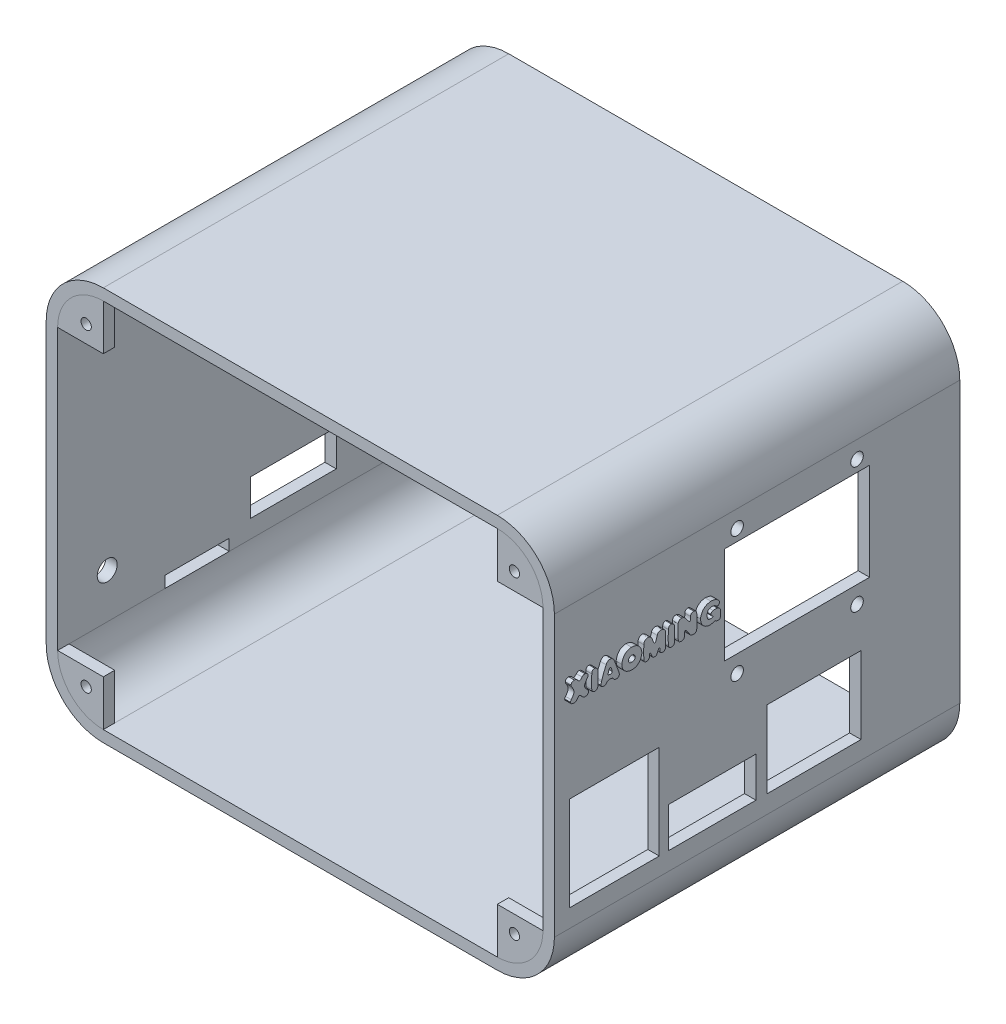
from build123d import *

# Parameters (mm, degrees)
EXTRUDE_1_DEPTH     = 71
SKETCH_2_R          = 0.9
EXTRUDE_2_DEPTH     = 2
EXTRUDE_2_2_DEPTH   = 2
EXTRUDE_2_3_DEPTH   = 2
EXTRUDE_2_4_DEPTH   = 2
EXTRUDE_START       = -2
SKETCH_3_R          = 0.9
EXTRUDE_3_DEPTH     = 2
SKETCH_5_W          = 15.2
SKETCH_5_H          = 16
SKETCH_5_W_2        = 14.8
SKETCH_5_H_2        = 6.5
SKETCH_5_W_3        = 16
SKETCH_5_H_3        = 13
CUT_EXTRUDE_1_DEPTH = 2
SKETCH_6_W          = 15
SKETCH_6_H          = 6.3
SKETCH_6_W_2        = 11.253172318
SKETCH_6_H_2        = 2
CUT_EXTRUDE_2_DEPTH = 2
SKETCH_7_W          = 15.7
SKETCH_7_H          = 16.5
SKETCH_7_W_2        = 15.3
SKETCH_7_H_2        = 7
SKETCH_7_W_3        = 16.5
SKETCH_7_H_3        = 13.5
CUT_EXTRUDE_3_DEPTH = 87
SKETCH_9_R          = 1.1
SKETCH_9_W          = 25.4
SKETCH_9_H          = 17
CUT_EXTRUDE_4_DEPTH = 2
EXTRUDE_4_DEPTH     = 1
SKETCH_11_R         = 1.75
CUT_EXTRUDE_5_DEPTH = 2


with BuildPart() as part:
    # Sketch 1 → Extrude 1 (new body)
    with BuildSketch(Plane.XY):
        with BuildLine():
            Line((8, 67), (77, 67))
            ThreePointArc((77, 67), (84.071067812, 64.071067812), (87, 57))
            Line((87, 57), (87, 8))
            ThreePointArc((87, 8), (84.071067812, 0.928932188), (77, -2))
            Line((77, -2), (8, -2))
            ThreePointArc((8, -2), (0.928932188, 0.928932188), (-2, 8))
            Line((-2, 8), (-2, 57))
            ThreePointArc((-2, 57), (0.928932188, 64.071067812), (8, 67))
        make_face()
        with BuildLine():
            Line((8, 0), (77, 0))
            ThreePointArc((77, 0), (82.656854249, 2.343145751), (85, 8))
            Line((85, 8), (85, 57))
            ThreePointArc((85, 57), (82.656854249, 62.656854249), (77, 65))
            Line((77, 65), (8, 65))
            ThreePointArc((8, 65), (2.343145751, 62.656854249), (0, 57))
            Line((0, 57), (0, 8))
            ThreePointArc((0, 8), (2.343145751, 2.343145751), (8, 0))
        make_face(mode=Mode.SUBTRACT)
    extrude(amount=-EXTRUDE_1_DEPTH)

    # Sketch 3 → Extrude 3 (add)
    # profile 1 of 4: a face of its own
    with BuildSketch(Plane(origin=(0, 0, -71), x_dir=(-1, 0, 0), z_dir=(0, 0, -1)).offset(EXTRUDE_START)):
        with BuildLine():
            Line((-77, 57), (-85, 57))
            ThreePointArc((-85, 57), (-82.656854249, 62.656854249), (-77, 65))
            Line((-77, 65), (-77, 57))
        make_face()
        with Locations(Location((-80, 60, 0), (0, 0, 180))):
            Circle(SKETCH_3_R, mode=Mode.SUBTRACT)
    # profile 2 of 4: a face of its own
    with BuildSketch(Plane(origin=(0, 0, -71), x_dir=(-1, 0, 0), z_dir=(0, 0, -1)).offset(EXTRUDE_START)):
        with BuildLine():
            Line((-8, 65), (-8, 57))
            Line((-8, 57), (0, 57))
            ThreePointArc((0, 57), (-2.343145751, 62.656854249), (-8, 65))
        make_face()
        with Locations(Location((-5, 60, 0), (0, 0, 180))):
            Circle(SKETCH_3_R, mode=Mode.SUBTRACT)
    # profile 3 of 4: a face of its own
    with BuildSketch(Plane(origin=(0, 0, -71), x_dir=(-1, 0, 0), z_dir=(0, 0, -1)).offset(EXTRUDE_START)):
        with BuildLine():
            Line((-8, 0), (-8, 8))
            Line((-8, 8), (0, 8))
            ThreePointArc((0, 8), (-2.343145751, 2.343145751), (-8, 0))
        make_face()
        with Locations(Location((-5, 5, 0), (0, 0, 180))):
            Circle(SKETCH_3_R, mode=Mode.SUBTRACT)
    # profile 4 of 4: a face of its own
    with BuildSketch(Plane(origin=(0, 0, -71), x_dir=(-1, 0, 0), z_dir=(0, 0, -1)).offset(EXTRUDE_START)):
        with BuildLine():
            Line((-77, 0), (-77, 8))
            Line((-77, 8), (-85, 8))
            ThreePointArc((-85, 8), (-82.656854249, 2.343145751), (-77, 0))
        make_face()
        with Locations(Location((-80, 5, 0), (0, 0, 180))):
            Circle(SKETCH_3_R, mode=Mode.SUBTRACT)
    extrude(amount=EXTRUDE_3_DEPTH)

    # Sketch 5 → Cut-Extrude 1 (cut)
    with BuildSketch(Plane(origin=(87, 0, 0), x_dir=(0, 0, -1), z_dir=(1, 0, 0))):
        with Locations((10.259998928, 19.140011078)):
            Rectangle(SKETCH_5_W, SKETCH_5_H)
        with Locations((27.899998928, 14.390011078)):
            Rectangle(SKETCH_5_W_2, SKETCH_5_H_2)
        with Locations((45.199998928, 17.640011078)):
            Rectangle(SKETCH_5_W_3, SKETCH_5_H_3)
    extrude(amount=-CUT_EXTRUDE_1_DEPTH, mode=Mode.SUBTRACT)

    # Sketch 6 → Cut-Extrude 2 (cut)
    with BuildSketch(Plane.ZY.offset(2)):
        with Locations((-41.299987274, 14.289982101)):
            Rectangle(SKETCH_6_W, SKETCH_6_H)
        with Locations((-24.426573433, 8.999982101)):
            Rectangle(SKETCH_6_W_2, SKETCH_6_H_2)
    extrude(amount=-CUT_EXTRUDE_2_DEPTH, mode=Mode.SUBTRACT)

    # Sketch 7 → Cut-Extrude 3 (cut)
    with BuildSketch(Plane(origin=(87, 0, 0), x_dir=(0, 0, -1), z_dir=(1, 0, 0))):
        with Locations((10.509998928, 19.390011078)):
            Rectangle(SKETCH_7_W, SKETCH_7_H)
        with Locations((27.649998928, 14.640011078)):
            Rectangle(SKETCH_7_W_2, SKETCH_7_H_2)
        with Locations((45.449998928, 17.890011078)):
            Rectangle(SKETCH_7_W_3, SKETCH_7_H_3)
    extrude(amount=-CUT_EXTRUDE_3_DEPTH, mode=Mode.SUBTRACT)

    # Sketch 9 → Cut-Extrude 4 (cut)
    with BuildSketch(Plane(origin=(87, 0, 0), x_dir=(0, 0, -1), z_dir=(1, 0, 0))):
        with Locations((32, 54)):
            Circle(SKETCH_9_R)
        with Locations((53, 54)):
            Circle(SKETCH_9_R)
        with Locations((32, 32)):
            Circle(SKETCH_9_R)
        with Locations((53, 32)):
            Circle(SKETCH_9_R)
        with Locations((42.5, 43.5)):
            Rectangle(SKETCH_9_W, SKETCH_9_H)
    extrude(amount=-CUT_EXTRUDE_4_DEPTH, mode=Mode.SUBTRACT)

    # Sketch 10 → Extrude 4 (add)
    # profile 1 of 8: a face of its own
    with BuildSketch(Plane(origin=(87, 0, 0), x_dir=(0, 0, -1), z_dir=(1, 0, 0))):
        with BuildLine():
            add(Edge.make_bspline(
                [(4.883857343, 43.565527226), (4.836471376, 43.611064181), (4.745934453, 43.698068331), (4.623432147, 43.829940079), (4.520112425, 43.955706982), (4.434978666, 44.074983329), (4.370639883, 44.18900654), (4.322846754, 44.296119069), (4.29515972, 44.398184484), (4.287606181, 44.497305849), (4.299791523, 44.59683092), (4.326285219, 44.701932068), (4.368281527, 44.815457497), (4.425891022, 44.937098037), (4.499275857, 45.067019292), (4.587498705, 45.205831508), (4.69118209, 45.353315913), (4.768409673, 45.452235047), (4.808588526, 45.503699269)],
                knots=[0, 0, 0, 0, 1.383602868, 2.643549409, 3.787215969, 4.809077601, 5.724630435, 6.539697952, 7.272921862, 7.939965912, 8.618973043, 9.374694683, 10.218040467, 11.163372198, 12.205761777, 13.357891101, 14.625401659, 16, 16, 16, 16], degree=3))
            add(Edge.make_bspline(
                [(4.808588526, 45.503699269), (4.818912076, 45.522928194), (4.838327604, 45.559092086), (4.863997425, 45.610509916), (4.885241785, 45.655558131), (4.901906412, 45.694062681), (4.914064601, 45.726136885), (4.921436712, 45.751611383), (4.924715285, 45.771185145), (4.922401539, 45.781788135), (4.921491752, 45.785957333)],
                knots=[0, 0, 0, 0, 1.703778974, 3.20430186, 4.486240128, 5.59123403, 6.480667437, 7.15830677, 7.66903809, 8, 8, 8, 8], degree=3))
            add(Edge.make_bspline(
                [(4.921491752, 45.785957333), (4.913290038, 45.811649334), (4.897488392, 45.861148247), (4.868049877, 45.931095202), (4.834018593, 45.993534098), (4.796341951, 46.049648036), (4.753531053, 46.097712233), (4.707258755, 46.139452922), (4.656699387, 46.174123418), (4.602814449, 46.200011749), (4.550862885, 46.22141068), (4.504070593, 46.240231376), (4.463669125, 46.256315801), (4.429702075, 46.269427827), (4.40232257, 46.279981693), (4.381579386, 46.287875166), (4.36711151, 46.292337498), (4.359539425, 46.293595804), (4.356975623, 46.29402185)],
                knots=[0, 0, 0, 0, 1.610362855, 3.102569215, 4.524476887, 5.85227692, 7.130201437, 8.3585765, 9.567040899, 10.777097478, 11.921320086, 12.923644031, 13.789405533, 14.518641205, 15.098441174, 15.541813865, 15.844864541, 16, 16, 16, 16], degree=3))
            add(Edge.make_bspline(
                [(4.356975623, 46.29402185), (4.316192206, 46.287717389), (4.240812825, 46.276064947), (4.138546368, 46.250564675), (4.055470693, 46.221031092), (3.992029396, 46.184633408), (3.944004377, 46.14687257), (3.904650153, 46.112722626), (3.872803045, 46.081242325), (3.85636624, 46.059334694), (3.848911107, 46.049398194)],
                knots=[0, 0, 0, 0, 1.704117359, 3.149694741, 4.34942045, 5.333932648, 6.155540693, 6.86972321, 7.487347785, 8, 8, 8, 8], degree=3))
            add(Edge.make_bspline(
                [(3.848911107, 46.049398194), (3.824990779, 46.021306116), (3.779434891, 45.967805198), (3.710995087, 45.895107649), (3.648936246, 45.831809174), (3.590748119, 45.780560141), (3.537921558, 45.740004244), (3.490492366, 45.708831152), (3.447261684, 45.689382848), (3.406731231, 45.68002258), (3.365898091, 45.684203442), (3.323559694, 45.701819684), (3.277348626, 45.730682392), (3.226391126, 45.770836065), (3.171715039, 45.823637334), (3.112613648, 45.88824697), (3.048463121, 45.964116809), (3.005832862, 46.019925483), (2.983319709, 46.049398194)],
                knots=[0, 0, 0, 0, 1.527102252, 2.908342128, 4.132359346, 5.195351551, 6.114748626, 6.888466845, 7.538792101, 8.068763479, 8.590291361, 9.208240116, 9.950416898, 10.841099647, 11.88866757, 13.09322539, 14.464924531, 16, 16, 16, 16], degree=3))
            add(Edge.make_bspline(
                [(2.983319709, 46.049398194), (2.955712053, 46.073050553), (2.902341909, 46.118774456), (2.816891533, 46.174386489), (2.731823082, 46.218118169), (2.660438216, 46.242753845), (2.606665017, 46.257030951), (2.572524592, 46.267435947), (2.543136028, 46.27430297), (2.519566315, 46.282092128), (2.500630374, 46.286198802), (2.487644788, 46.290796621), (2.479684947, 46.292921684), (2.476184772, 46.293790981), (2.475255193, 46.29402185)],
                knots=[0, 0, 0, 0, 2.289414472, 4.425815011, 6.410154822, 8.304429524, 9.17139153, 9.917654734, 10.553441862, 11.072422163, 11.480878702, 11.772655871, 11.939621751, 12, 12, 12, 12], degree=3))
            add(Edge.make_bspline(
                [(2.475255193, 46.29402185), (2.443784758, 46.287511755), (2.383586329, 46.275058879), (2.298729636, 46.249901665), (2.223310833, 46.220575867), (2.156276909, 46.188463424), (2.099598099, 46.150568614), (2.051628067, 46.109144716), (2.013638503, 46.062803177), (1.985555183, 46.013357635), (1.965291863, 45.964948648), (1.947014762, 45.922040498), (1.93237719, 45.885075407), (1.92083493, 45.854104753), (1.913046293, 45.828629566), (1.908961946, 45.809267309), (1.906638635, 45.795096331), (1.909608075, 45.78847807), (1.910739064, 45.785957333)],
                knots=[0, 0, 0, 0, 1.865869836, 3.569141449, 5.132599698, 6.562638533, 7.876096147, 9.080604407, 10.231159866, 11.337350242, 12.370269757, 13.27735863, 14.046528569, 14.678214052, 15.199017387, 15.585373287, 15.842078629, 16, 16, 16, 16], degree=3))
            add(Edge.make_bspline(
                [(1.910739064, 45.785957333), (1.909017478, 45.758953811), (1.9056749, 45.706524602), (1.921685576, 45.630241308), (1.954254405, 45.560824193), (1.987771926, 45.522962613), (2.004825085, 45.503699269)],
                knots=[0, 0, 0, 0, 1.050010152, 2.038667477, 3.00210654, 4, 4, 4, 4], degree=3))
            add(Edge.make_bspline(
                [(2.004825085, 45.503699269), (2.037437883, 45.453491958), (2.10024059, 45.356807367), (2.185574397, 45.214228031), (2.257617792, 45.079526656), (2.317387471, 44.953168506), (2.364737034, 44.83489718), (2.398302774, 44.724276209), (2.420958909, 44.622321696), (2.430333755, 44.525331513), (2.424365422, 44.428486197), (2.402228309, 44.327016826), (2.365491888, 44.217934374), (2.312433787, 44.101666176), (2.244008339, 43.977776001), (2.160147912, 43.846496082), (2.06061529, 43.707492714), (1.986881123, 43.614232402), (1.948373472, 43.565527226)],
                knots=[0, 0, 0, 0, 1.324562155, 2.550719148, 3.675150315, 4.702952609, 5.642150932, 6.490905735, 7.258062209, 7.949566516, 8.639540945, 9.395579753, 10.240778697, 11.181733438, 12.219155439, 13.369864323, 14.626412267, 16, 16, 16, 16], degree=3))
            add(Edge.make_bspline(
                [(1.948373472, 43.565527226), (1.933954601, 43.541839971), (1.907022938, 43.497596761), (1.869828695, 43.435998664), (1.840275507, 43.382723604), (1.817953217, 43.338452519), (1.802068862, 43.302674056), (1.793313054, 43.276608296), (1.789621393, 43.256417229), (1.79561846, 43.248545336), (1.797835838, 43.245634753)],
                knots=[0, 0, 0, 0, 1.843424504, 3.443160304, 4.784176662, 5.889230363, 6.747010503, 7.362433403, 7.764263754, 8, 8, 8, 8], degree=3))
            add(Edge.make_bspline(
                [(1.797835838, 43.245634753), (1.801678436, 43.221591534), (1.809095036, 43.175185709), (1.829125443, 43.109704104), (1.857638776, 43.051768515), (1.892239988, 43.000014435), (1.935967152, 42.956265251), (1.98630084, 42.919019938), (2.044387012, 42.889612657), (2.107516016, 42.86856501), (2.17019256, 42.852654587), (2.227171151, 42.837552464), (2.277184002, 42.826291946), (2.319722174, 42.81811037), (2.355056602, 42.812043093), (2.382648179, 42.80948759), (2.403576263, 42.807994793), (2.414422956, 42.811445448), (2.41880358, 42.812839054)],
                knots=[0, 0, 0, 0, 1.391689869, 2.686101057, 3.89838733, 5.074075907, 6.229771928, 7.417710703, 8.641880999, 9.936155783, 11.215751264, 12.340478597, 13.307540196, 14.146646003, 14.819464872, 15.353610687, 15.738944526, 16, 16, 16, 16], degree=3))
            add(Edge.make_bspline(
                [(2.41880358, 42.812839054), (2.457052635, 42.816312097), (2.528572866, 42.822806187), (2.626472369, 42.845708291), (2.709565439, 42.87336129), (2.774837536, 42.913200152), (2.827513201, 42.954795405), (2.873303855, 42.991974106), (2.91213454, 43.025673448), (2.935065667, 43.047400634), (2.9456853, 43.05746271)],
                knots=[0, 0, 0, 0, 1.541214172, 2.881848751, 4.033527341, 5.042161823, 5.934638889, 6.730708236, 7.41217837, 8, 8, 8, 8], degree=3))
            add(Edge.make_bspline(
                [(2.9456853, 43.05746271), (2.969752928, 43.094388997), (3.014984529, 43.163786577), (3.083468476, 43.258128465), (3.14640474, 43.337253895), (3.204910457, 43.400911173), (3.259132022, 43.448944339), (3.308543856, 43.48251059), (3.354459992, 43.500630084), (3.398753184, 43.501830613), (3.441459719, 43.485556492), (3.488179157, 43.460131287), (3.540377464, 43.42212819), (3.598990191, 43.373459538), (3.662240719, 43.310983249), (3.732138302, 43.237497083), (3.808498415, 43.15225481), (3.859601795, 43.090187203), (3.886545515, 43.05746271)],
                knots=[0, 0, 0, 0, 1.601628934, 3.010028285, 4.234935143, 5.274303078, 6.147940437, 6.862177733, 7.436337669, 7.917640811, 8.432917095, 9.075055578, 9.850398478, 10.773543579, 11.842293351, 13.07840876, 14.459621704, 16, 16, 16, 16], degree=3))
            add(Edge.make_bspline(
                [(3.886545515, 43.05746271), (3.911630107, 43.030925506), (3.95985441, 42.979908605), (4.041530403, 42.917647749), (4.126123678, 42.870280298), (4.199477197, 42.843703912), (4.256210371, 42.830963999), (4.293114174, 42.821224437), (4.325498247, 42.814910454), (4.352763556, 42.811072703), (4.375038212, 42.807827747), (4.392265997, 42.806795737), (4.405160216, 42.80815536), (4.411151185, 42.811549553), (4.413427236, 42.812839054)],
                knots=[0, 0, 0, 0, 2.181855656, 4.194545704, 6.116953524, 7.963500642, 8.836605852, 9.595096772, 10.246579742, 10.808765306, 11.243210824, 11.590967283, 11.844602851, 12, 12, 12, 12], degree=3))
            add(Edge.make_bspline(
                [(4.413427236, 42.812839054), (4.444848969, 42.816379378), (4.504940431, 42.823149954), (4.590139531, 42.839287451), (4.66666304, 42.858866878), (4.733610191, 42.884278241), (4.792716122, 42.912209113), (4.841499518, 42.94656529), (4.88208173, 42.984711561), (4.911895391, 43.027502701), (4.935333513, 43.069800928), (4.956094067, 43.108113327), (4.974508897, 43.141519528), (4.989310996, 43.170738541), (5.000228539, 43.195840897), (5.00889494, 43.216046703), (5.014460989, 43.232100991), (5.015249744, 43.241659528), (5.015577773, 43.245634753)],
                knots=[0, 0, 0, 0, 1.888125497, 3.610883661, 5.176042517, 6.598775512, 7.883385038, 9.069077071, 10.148595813, 11.192291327, 12.168196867, 13.037558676, 13.795069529, 14.446675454, 14.993347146, 15.428857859, 15.76247215, 16, 16, 16, 16], degree=3))
            add(Edge.make_bspline(
                [(5.015577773, 43.245634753), (5.008924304, 43.280677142), (4.996468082, 43.346281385), (4.967469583, 43.435463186), (4.931662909, 43.509285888), (4.899017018, 43.547692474), (4.883857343, 43.565527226)],
                knots=[0, 0, 0, 0, 1.21871494, 2.281604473, 3.202033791, 4, 4, 4, 4], degree=3))
        make_face()
    # profile 2 of 8: a face of its own
    with BuildSketch(Plane(origin=(87, 0, 0), x_dir=(0, 0, -1), z_dir=(1, 0, 0))):
        with BuildLine():
            add(Edge.make_bspline(
                [(6.622009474, 43.302086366), (6.629874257, 43.499756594), (6.645590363, 43.894758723), (6.653074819, 44.48780241), (6.645610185, 45.080614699), (6.629874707, 45.475616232), (6.622009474, 45.673054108)],
                knots=[0, 0, 0, 0, 1.00085636, 1.999999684, 3.000318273, 4, 4, 4, 4], degree=3))
            add(Edge.make_bspline(
                [(6.622009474, 45.673054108), (6.615521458, 45.703143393), (6.603022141, 45.761111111), (6.577259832, 45.842788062), (6.5466851, 45.915964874), (6.511048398, 45.980397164), (6.471294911, 46.036940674), (6.426534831, 46.084904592), (6.376427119, 46.124053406), (6.322311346, 46.15258262), (6.270155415, 46.175982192), (6.223336, 46.196854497), (6.183087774, 46.215139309), (6.149133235, 46.229689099), (6.121634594, 46.240912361), (6.100862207, 46.249295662), (6.086538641, 46.254773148), (6.078880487, 46.255981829), (6.076310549, 46.256387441)],
                knots=[0, 0, 0, 0, 1.729165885, 3.331278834, 4.805622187, 6.178984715, 7.461464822, 8.680644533, 9.853214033, 11.01607612, 12.108495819, 13.06693283, 13.896783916, 14.592803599, 15.143171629, 15.565023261, 15.854029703, 16, 16, 16, 16], degree=3))
            add(Edge.make_bspline(
                [(6.076310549, 46.256387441), (6.044862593, 46.25149878), (5.985064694, 46.242203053), (5.900964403, 46.221879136), (5.826815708, 46.197973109), (5.7626824, 46.169401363), (5.708181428, 46.136788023), (5.663878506, 46.099553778), (5.627927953, 46.058853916), (5.598385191, 45.998046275), (5.573126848, 45.923011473), (5.553065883, 45.835400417), (5.543407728, 45.752390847), (5.547471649, 45.698842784), (5.549428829, 45.673054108)],
                knots=[0, 0, 0, 0, 1.272642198, 2.419913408, 3.457288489, 4.384828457, 5.223164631, 5.988250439, 6.693851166, 7.375547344, 8.67458471, 9.855938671, 10.967422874, 12, 12, 12, 12], degree=3))
            add(Edge.make_bspline(
                [(5.549428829, 45.673054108), (5.542023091, 45.574350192), (5.527220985, 45.377067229), (5.512858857, 45.080545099), (5.504628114, 44.784051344), (5.501791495, 44.487570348), (5.504614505, 44.191320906), (5.512895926, 43.894829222), (5.527192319, 43.598304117), (5.542019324, 43.40079011), (5.549428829, 43.302086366)],
                knots=[0, 0, 0, 0, 1.000861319, 2.000456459, 3.00157964, 4.000000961, 4.998422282, 5.997197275, 6.999138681, 8, 8, 8, 8], degree=3))
            add(Edge.make_bspline(
                [(5.549428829, 43.302086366), (5.553061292, 43.270635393), (5.55996855, 43.210830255), (5.578362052, 43.126698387), (5.601061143, 43.051974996), (5.632329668, 42.988220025), (5.66763492, 42.933146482), (5.710112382, 42.888736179), (5.758104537, 42.853205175), (5.811915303, 42.830999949), (5.86448752, 42.815096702), (5.912031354, 42.79948819), (5.953699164, 42.78597687), (5.98988374, 42.775886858), (6.01969748, 42.767135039), (6.043710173, 42.761642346), (6.061801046, 42.757769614), (6.072119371, 42.756786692), (6.076310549, 42.756387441)],
                knots=[0, 0, 0, 0, 1.797407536, 3.417834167, 4.886953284, 6.220929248, 7.439808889, 8.58797721, 9.694115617, 10.804967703, 11.873381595, 12.816598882, 13.647192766, 14.361435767, 14.950604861, 15.411568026, 15.760986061, 16, 16, 16, 16], degree=3))
            add(Edge.make_bspline(
                [(6.076310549, 42.756387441), (6.106118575, 42.759851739), (6.16331982, 42.766499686), (6.244126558, 42.783699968), (6.315819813, 42.80665345), (6.378372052, 42.834448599), (6.432628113, 42.867053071), (6.476833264, 42.906594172), (6.512738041, 42.950905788), (6.544908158, 43.015046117), (6.572315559, 43.092200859), (6.600589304, 43.173970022), (6.617326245, 43.242662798), (6.620576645, 43.283905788), (6.622009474, 43.302086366)],
                knots=[0, 0, 0, 0, 1.252866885, 2.404236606, 3.444431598, 4.39119037, 5.258223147, 6.076085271, 6.856484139, 7.624724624, 9.059069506, 10.27413246, 11.239209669, 12, 12, 12, 12], degree=3))
        make_face()
    # profile 3 of 8: a face of its own
    with BuildSketch(Plane(origin=(87, 0, 0), x_dir=(0, 0, -1), z_dir=(1, 0, 0))):
        with BuildLine():
            add(Edge.make_bspline(
                [(8.114841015, 42.982193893), (8.129707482, 43.00502942), (8.159304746, 43.050492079), (8.216204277, 43.109216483), (8.281384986, 43.159942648), (8.354978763, 43.203482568), (8.437847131, 43.238118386), (8.529349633, 43.26445716), (8.629488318, 43.282940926), (8.735752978, 43.293903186), (8.843105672, 43.295674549), (8.946137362, 43.28647071), (9.042249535, 43.264701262), (9.131246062, 43.231319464), (9.213151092, 43.185891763), (9.288430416, 43.129928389), (9.356094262, 43.061556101), (9.393933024, 43.008995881), (9.413228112, 42.982193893)],
                knots=[0, 0, 0, 0, 0.86626335, 1.724621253, 2.589081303, 3.491382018, 4.439691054, 5.441898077, 6.518742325, 7.679141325, 8.840978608, 9.933647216, 10.965810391, 11.970445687, 12.950778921, 13.939371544, 14.949225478, 16, 16, 16, 16], degree=3))
            add(Edge.make_bspline(
                [(9.413228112, 42.982193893), (9.426700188, 42.958537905), (9.45317975, 42.912041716), (9.513320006, 42.85758578), (9.584461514, 42.815530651), (9.665408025, 42.793412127), (9.741487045, 42.777967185), (9.804701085, 42.767612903), (9.849724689, 42.758298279), (9.874344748, 42.756911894), (9.883658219, 42.756387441)],
                knots=[0, 0, 0, 0, 1.187119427, 2.333300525, 3.511244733, 4.781064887, 5.988089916, 6.919531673, 7.591271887, 8, 8, 8, 8], degree=3))
            add(Edge.make_bspline(
                [(9.883658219, 42.756387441), (9.909286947, 42.759674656), (9.958298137, 42.765960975), (10.027794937, 42.781825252), (10.090608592, 42.799890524), (10.146084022, 42.823125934), (10.194640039, 42.849510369), (10.236442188, 42.879593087), (10.271410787, 42.913958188), (10.304900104, 42.96341982), (10.336212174, 43.020313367), (10.365102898, 43.077589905), (10.386071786, 43.118659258), (10.39018878, 43.142620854), (10.391722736, 43.151548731)],
                knots=[0, 0, 0, 0, 1.338475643, 2.559638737, 3.691067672, 4.721984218, 5.670495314, 6.549588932, 7.384004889, 8.195874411, 9.635647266, 10.745011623, 11.532402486, 12, 12, 12, 12], degree=3))
            add(Edge.make_bspline(
                [(10.391722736, 43.151548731), (10.387921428, 43.171557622), (10.379839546, 43.214098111), (10.36372095, 43.281412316), (10.341734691, 43.355327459), (10.321313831, 43.420318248), (10.303320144, 43.471881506), (10.293260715, 43.507390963), (10.284493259, 43.537913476), (10.279009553, 43.563789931), (10.275302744, 43.584979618), (10.273635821, 43.601424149), (10.274155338, 43.613965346), (10.277498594, 43.619709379), (10.27881951, 43.621978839)],
                knots=[0, 0, 0, 0, 1.5048796, 3.199493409, 5.111836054, 7.201984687, 8.233399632, 9.145969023, 9.928878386, 10.57871311, 11.100809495, 11.514231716, 11.808073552, 12, 12, 12, 12], degree=3))
            add(Edge.make_bspline(
                [(10.27881951, 43.621978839), (10.270611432, 43.641931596), (10.255884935, 43.677729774), (10.237280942, 43.72569882), (10.225802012, 43.762268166), (10.223333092, 43.783164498), (10.222367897, 43.791333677)],
                knots=[0, 0, 0, 0, 1.444999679, 2.592541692, 3.449770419, 4, 4, 4, 4], degree=3))
            add(Edge.make_bspline(
                [(10.222367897, 43.791333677), (10.167344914, 43.95815001), (10.056570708, 44.293990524), (9.875844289, 44.796597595), (9.680042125, 45.30109536), (9.540094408, 45.636177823), (9.469679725, 45.804774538)],
                knots=[0, 0, 0, 0, 0.980264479, 1.973502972, 2.980368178, 4, 4, 4, 4], degree=3))
            add(Edge.make_bspline(
                [(9.469679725, 45.804774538), (9.446037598, 45.844979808), (9.400598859, 45.92225191), (9.322882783, 46.026274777), (9.240201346, 46.114297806), (9.153034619, 46.187284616), (9.059863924, 46.242866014), (8.962506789, 46.283290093), (8.860264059, 46.308356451), (8.754861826, 46.315097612), (8.649663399, 46.308383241), (8.548163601, 46.283209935), (8.451857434, 46.243359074), (8.3610426, 46.187116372), (8.276678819, 46.114175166), (8.196839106, 46.026281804), (8.122534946, 45.922372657), (8.080329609, 45.844997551), (8.058389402, 45.804774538)],
                knots=[0, 0, 0, 0, 1.220841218, 2.34638312, 3.392213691, 4.37763556, 5.313565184, 6.221959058, 7.129476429, 8.056664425, 8.977784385, 9.879388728, 10.782162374, 11.697295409, 12.664059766, 13.693336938, 14.800894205, 16, 16, 16, 16], degree=3))
            add(Edge.make_bspline(
                [(8.058389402, 45.804774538), (7.985220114, 45.638692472), (7.83946496, 45.307852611), (7.642275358, 44.805117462), (7.462828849, 44.300364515), (7.357953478, 43.960610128), (7.30570123, 43.791333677)],
                knots=[0, 0, 0, 0, 1.012337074, 2.016602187, 3.011808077, 4, 4, 4, 4], degree=3))
            add(Edge.make_bspline(
                [(7.30570123, 43.791333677), (7.297493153, 43.77138092), (7.282766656, 43.735582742), (7.264162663, 43.687613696), (7.252683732, 43.651044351), (7.250214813, 43.630148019), (7.249249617, 43.621978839)],
                knots=[0, 0, 0, 0, 1.444999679, 2.592541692, 3.449770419, 4, 4, 4, 4], degree=3))
            add(Edge.make_bspline(
                [(7.249249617, 43.621978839), (7.237498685, 43.583911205), (7.215683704, 43.513240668), (7.187347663, 43.414700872), (7.163562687, 43.331967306), (7.148084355, 43.265377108), (7.133489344, 43.213420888), (7.131598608, 43.181324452), (7.125355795, 43.156077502), (7.133969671, 43.15252808), (7.136346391, 43.151548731)],
                knots=[0, 0, 0, 0, 1.949728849, 3.619567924, 5.023884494, 6.149177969, 7.001533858, 7.575670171, 7.882919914, 8, 8, 8, 8], degree=3))
            add(Edge.make_bspline(
                [(7.136346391, 43.151548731), (7.141513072, 43.129136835), (7.151435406, 43.086095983), (7.172305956, 43.025669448), (7.19803381, 42.972153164), (7.228851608, 42.92559086), (7.264425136, 42.886095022), (7.305177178, 42.854276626), (7.349964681, 42.828406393), (7.399085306, 42.812556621), (7.446853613, 42.799968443), (7.490826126, 42.788798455), (7.529460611, 42.779322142), (7.562528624, 42.770597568), (7.590393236, 42.764117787), (7.613265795, 42.760314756), (7.630609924, 42.756910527), (7.640452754, 42.756537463), (7.644410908, 42.756387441)],
                knots=[0, 0, 0, 0, 1.565105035, 3.005700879, 4.342631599, 5.597222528, 6.795204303, 7.943828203, 9.105230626, 10.295776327, 11.44298372, 12.471050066, 13.384028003, 14.151245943, 14.799718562, 15.330216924, 15.730656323, 16, 16, 16, 16], degree=3))
            add(Edge.make_bspline(
                [(7.644410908, 42.756387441), (7.682131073, 42.759936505), (7.751666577, 42.766479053), (7.846200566, 42.784365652), (7.922886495, 42.806610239), (7.981646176, 42.837427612), (8.025729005, 42.872910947), (8.063128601, 42.907169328), (8.092962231, 42.943616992), (8.10773673, 42.969667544), (8.114841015, 42.982193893)],
                knots=[0, 0, 0, 0, 1.66019372, 3.060495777, 4.213745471, 5.147810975, 5.94644216, 6.688581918, 7.369407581, 8, 8, 8, 8], degree=3))
        make_face()
        with BuildLine():
            add(Edge.make_bspline(
                [(9.130970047, 44.261763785), (9.129821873, 44.240869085), (9.127626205, 44.200911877), (9.105193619, 44.145067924), (9.068721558, 44.097771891), (9.017791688, 44.061501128), (8.958569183, 44.033342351), (8.892450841, 44.013417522), (8.820649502, 44.000739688), (8.745099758, 43.997064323), (8.669557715, 44.000778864), (8.597979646, 44.013418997), (8.531880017, 44.033337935), (8.481853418, 44.057114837), (8.446695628, 44.080041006), (8.425487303, 44.100002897), (8.40807684, 44.121751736), (8.396562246, 44.146184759), (8.389009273, 44.172320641), (8.387488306, 44.200443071), (8.389301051, 44.230773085), (8.394424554, 44.251134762), (8.39709908, 44.261763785)],
                knots=[0, 0, 0, 0, 1.203197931, 2.300891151, 3.421447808, 4.611751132, 5.879590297, 7.201169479, 8.592666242, 10.086077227, 11.566073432, 12.957570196, 14.279149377, 15.546988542, 16.146897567, 16.698205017, 17.224900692, 17.747640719, 18.249596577, 18.788487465, 19.367576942, 20, 20, 20, 20], degree=3))
            add(Edge.make_bspline(
                [(8.39709908, 44.261763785), (8.404861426, 44.295945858), (8.419835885, 44.361887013), (8.443782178, 44.457089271), (8.467192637, 44.545225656), (8.490741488, 44.626151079), (8.514781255, 44.699697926), (8.537691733, 44.766579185), (8.562879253, 44.82581166), (8.585434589, 44.87891343), (8.610498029, 44.923900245), (8.634336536, 44.962105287), (8.658345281, 44.993654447), (8.682338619, 45.018253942), (8.706994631, 45.035939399), (8.732512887, 45.045245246), (8.758062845, 45.048737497), (8.792878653, 45.040734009), (8.835993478, 45.015749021), (8.883840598, 44.966835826), (8.927949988, 44.897433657), (8.972887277, 44.809700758), (9.013959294, 44.700978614), (9.056187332, 44.573088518), (9.095223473, 44.424412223), (9.118594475, 44.318073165), (9.130970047, 44.261763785)],
                knots=[0, 0, 0, 0, 1.400354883, 2.701445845, 3.921668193, 5.043581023, 6.067924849, 7.013150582, 7.866314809, 8.639055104, 9.31607419, 9.921134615, 10.437222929, 10.896619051, 11.29049652, 11.637022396, 11.973201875, 12.30447713, 13.04371783, 13.929720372, 15.013437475, 16.316810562, 17.862792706, 19.650213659, 21.696671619, 24, 24, 24, 24], degree=3))
        make_face(mode=Mode.SUBTRACT)
    # profile 4 of 8: a face of its own
    with BuildSketch(Plane(origin=(87, 0, 0), x_dir=(0, 0, -1), z_dir=(1, 0, 0))):
        with BuildLine():
            add(Edge.make_bspline(
                [(10.821730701, 44.468753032), (10.823942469, 44.418303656), (10.828253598, 44.319968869), (10.844165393, 44.176733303), (10.868741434, 44.042051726), (10.899844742, 43.915240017), (10.938713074, 43.796521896), (10.985440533, 43.685953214), (11.039700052, 43.583548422), (11.102438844, 43.490280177), (11.169279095, 43.404065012), (11.239176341, 43.324518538), (11.31103973, 43.251203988), (11.384804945, 43.18381633), (11.461786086, 43.12395483), (11.540653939, 43.070121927), (11.6217447, 43.0222381), (11.731202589, 42.9694308), (11.864866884, 42.914020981), (12.018692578, 42.860645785), (12.161362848, 42.818466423), (12.274003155, 42.7973697), (12.355902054, 42.785356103), (12.408388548, 42.777569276), (12.453680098, 42.771212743), (12.491606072, 42.766544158), (12.522062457, 42.762542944), (12.544921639, 42.758396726), (12.560813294, 42.75731914), (12.568943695, 42.756625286), (12.571730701, 42.756387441)],
                knots=[0, 0, 0, 0, 1.553776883, 3.028586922, 4.430914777, 5.764338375, 7.043970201, 8.27093092, 9.454357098, 10.604423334, 11.725570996, 12.809727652, 13.861288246, 14.883718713, 15.881967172, 16.859572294, 17.820885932, 18.776894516, 20.597226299, 22.27038548, 23.786652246, 25.170543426, 25.792371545, 26.334308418, 26.803448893, 27.19983445, 27.510234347, 27.74885525, 27.913910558, 28, 28, 28, 28], degree=3))
            add(Edge.make_bspline(
                [(12.571730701, 42.756387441), (12.62220242, 42.759972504), (12.720632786, 42.766964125), (12.863566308, 42.787141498), (12.998678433, 42.811694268), (13.12550397, 42.843359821), (13.243695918, 42.882971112), (13.354363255, 42.926962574), (13.456402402, 42.978708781), (13.550175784, 43.036912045), (13.636119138, 43.100027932), (13.716765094, 43.164703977), (13.790781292, 43.232454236), (13.858652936, 43.302888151), (13.920074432, 43.376450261), (13.975962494, 43.452022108), (14.025026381, 43.530731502), (14.081120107, 43.63685561), (14.139903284, 43.767478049), (14.199035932, 43.918149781), (14.24447712, 44.059305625), (14.270434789, 44.171333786), (14.284978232, 44.254104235), (14.295250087, 44.308340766), (14.302292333, 44.356608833), (14.309953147, 44.398246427), (14.314310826, 44.434169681), (14.318924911, 44.463557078), (14.321131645, 44.487071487), (14.3215505, 44.500577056), (14.321730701, 44.506387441)],
                knots=[0, 0, 0, 0, 1.546972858, 3.016919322, 4.411738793, 5.745419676, 7.010281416, 8.221386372, 9.384270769, 10.504104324, 11.59264842, 12.64339523, 13.664197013, 14.659081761, 15.632399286, 16.592980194, 17.531313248, 18.465765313, 20.262025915, 21.908555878, 23.413974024, 24.792632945, 25.421090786, 25.984097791, 26.480499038, 26.912649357, 27.278376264, 27.586829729, 27.822245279, 28, 28, 28, 28], degree=3))
            add(Edge.make_bspline(
                [(14.321730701, 44.506387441), (14.31667853, 44.555470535), (14.30682739, 44.651176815), (14.283610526, 44.790537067), (14.254203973, 44.921817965), (14.220667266, 45.046269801), (14.17902969, 45.162275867), (14.133684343, 45.271535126), (14.081020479, 45.372607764), (14.022275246, 45.46561974), (13.959892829, 45.552289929), (13.895278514, 45.633069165), (13.828096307, 45.70805234), (13.758599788, 45.777048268), (13.686465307, 45.839860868), (13.612648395, 45.897487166), (13.535738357, 45.948306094), (13.432103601, 46.00736524), (13.303696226, 46.070583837), (13.151933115, 46.132121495), (13.006427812, 46.1800008), (12.888189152, 46.205253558), (12.799629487, 46.219669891), (12.740055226, 46.230076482), (12.685756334, 46.237050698), (12.63712626, 46.244755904), (12.594007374, 46.248961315), (12.556718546, 46.253826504), (12.524827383, 46.255823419), (12.505291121, 46.25621188), (12.496461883, 46.256387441)],
                knots=[0, 0, 0, 0, 1.480065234, 2.885953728, 4.235338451, 5.515353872, 6.749777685, 7.930335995, 9.061923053, 10.164175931, 11.227968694, 12.264189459, 13.266090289, 14.246822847, 15.200128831, 16.134157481, 17.054274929, 17.962837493, 19.711440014, 21.343469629, 22.873131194, 24.300382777, 24.964946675, 25.565343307, 26.11435036, 26.607174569, 27.042034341, 27.413781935, 27.735064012, 28, 28, 28, 28], degree=3))
            add(Edge.make_bspline(
                [(12.496461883, 46.256387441), (12.447610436, 46.251091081), (12.352352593, 46.240763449), (12.213824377, 46.217073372), (12.083840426, 46.186382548), (11.961638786, 46.150345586), (11.847732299, 46.10741833), (11.742406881, 46.056654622), (11.644082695, 46.00169381), (11.55564147, 45.938038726), (11.474050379, 45.870566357), (11.397354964, 45.801409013), (11.326954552, 45.728990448), (11.260867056, 45.655560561), (11.201954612, 45.578282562), (11.147177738, 45.499935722), (11.098979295, 45.41839844), (11.042995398, 45.309452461), (10.984999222, 45.175271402), (10.924845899, 45.021990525), (10.879850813, 44.878556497), (10.853187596, 44.76603904), (10.839811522, 44.683839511), (10.830084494, 44.631522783), (10.82394115, 44.586366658), (10.819893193, 44.548704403), (10.816754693, 44.518489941), (10.815753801, 44.495518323), (10.816842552, 44.479155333), (10.820438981, 44.471501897), (10.821730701, 44.468753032)],
                knots=[0, 0, 0, 0, 1.527625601, 2.978792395, 4.366456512, 5.678254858, 6.9379672, 8.146349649, 9.311088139, 10.435458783, 11.528677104, 12.602512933, 13.644537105, 14.667917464, 15.672074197, 16.6638922, 17.638837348, 18.614504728, 20.470806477, 22.181182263, 23.732465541, 25.14123255, 25.771823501, 26.32165675, 26.795657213, 27.188121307, 27.500068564, 27.738550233, 27.906095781, 28, 28, 28, 28], degree=3))
        make_face()
        with BuildLine():
            add(Edge.make_bspline(
                [(13.173881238, 44.468753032), (13.168665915, 44.437271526), (13.158712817, 44.377191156), (13.135091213, 44.292672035), (13.104468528, 44.218598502), (13.068260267, 44.153828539), (13.024638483, 44.099164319), (12.973852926, 44.055076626), (12.917275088, 44.019531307), (12.855014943, 43.997740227), (12.794548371, 43.981749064), (12.740369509, 43.966609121), (12.693553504, 43.955560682), (12.654580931, 43.947172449), (12.622892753, 43.941042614), (12.599165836, 43.938834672), (12.582066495, 43.936692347), (12.57447285, 43.940497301), (12.571730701, 43.941871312)],
                knots=[0, 0, 0, 0, 1.712899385, 3.268955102, 4.700819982, 6.008423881, 7.241784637, 8.435382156, 9.605803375, 10.806097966, 11.959438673, 12.967220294, 13.826618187, 14.541136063, 15.111359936, 15.550863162, 15.837811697, 16, 16, 16, 16], degree=3))
            add(Edge.make_bspline(
                [(12.571730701, 43.941871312), (12.537295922, 43.944118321), (12.471864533, 43.948387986), (12.379179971, 43.962858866), (12.296975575, 43.98404617), (12.225291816, 44.012614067), (12.163450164, 44.047335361), (12.112318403, 44.089699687), (12.071521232, 44.138941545), (12.044103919, 44.194494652), (12.024154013, 44.249118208), (12.005512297, 44.298661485), (11.991148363, 44.342219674), (11.979582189, 44.379508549), (11.971857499, 44.410503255), (11.967481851, 44.435310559), (11.965627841, 44.45434566), (11.968439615, 44.464595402), (11.969580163, 44.468753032)],
                knots=[0, 0, 0, 0, 1.831842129, 3.480782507, 4.973997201, 6.330206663, 7.56813816, 8.724382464, 9.838050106, 10.936096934, 11.9945506, 12.927348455, 13.746610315, 14.429607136, 15.001109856, 15.439197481, 15.772520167, 16, 16, 16, 16], degree=3))
            add(Edge.make_bspline(
                [(11.969580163, 44.468753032), (11.974881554, 44.500212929), (11.985025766, 44.560411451), (12.007626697, 44.645486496), (12.037763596, 44.720391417), (12.073109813, 44.78616668), (12.115212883, 44.842145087), (12.163852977, 44.887918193), (12.218457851, 44.924764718), (12.278585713, 44.948752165), (12.337503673, 44.966981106), (12.390782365, 44.984027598), (12.437499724, 44.997263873), (12.477401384, 45.007398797), (12.510769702, 45.013556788), (12.537176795, 45.017385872), (12.557099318, 45.018330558), (12.567572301, 45.015554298), (12.571730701, 45.014451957)],
                knots=[0, 0, 0, 0, 1.692354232, 3.238320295, 4.659761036, 5.967171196, 7.189970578, 8.358443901, 9.496883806, 10.662232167, 11.777071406, 12.771238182, 13.629671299, 14.353157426, 14.95513427, 15.427574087, 15.772712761, 16, 16, 16, 16], degree=3))
            add(Edge.make_bspline(
                [(12.571730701, 45.014451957), (12.604609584, 45.009497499), (12.667652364, 44.9999977), (12.756300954, 44.976502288), (12.835515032, 44.949254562), (12.90495216, 44.915867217), (12.963786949, 44.875811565), (13.013908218, 44.83113763), (13.052749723, 44.779492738), (13.080171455, 44.723748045), (13.10127002, 44.669602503), (13.120038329, 44.620937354), (13.13603699, 44.579108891), (13.14949223, 44.544112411), (13.159775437, 44.515696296), (13.167606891, 44.494245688), (13.172319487, 44.479376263), (13.173469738, 44.471552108), (13.173881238, 44.468753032)],
                knots=[0, 0, 0, 0, 1.802693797, 3.456529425, 4.967354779, 6.342727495, 7.622182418, 8.817616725, 9.969605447, 11.102614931, 12.176898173, 13.122518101, 13.932403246, 14.606558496, 15.156811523, 15.571397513, 15.846668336, 16, 16, 16, 16], degree=3))
        make_face(mode=Mode.SUBTRACT)
    # profile 5 of 8: a face of its own
    with BuildSketch(Plane(origin=(87, 0, 0), x_dir=(0, 0, -1), z_dir=(1, 0, 0))):
        with BuildLine():
            add(Edge.make_bspline(
                [(16.977047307, 43.019828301), (16.989292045, 43.049360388), (17.013056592, 43.106676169), (17.048609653, 43.189279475), (17.082072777, 43.266273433), (17.113915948, 43.337238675), (17.144781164, 43.402199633), (17.17368451, 43.461411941), (17.201974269, 43.514279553), (17.227047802, 43.561759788), (17.252100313, 43.602522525), (17.274496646, 43.638045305), (17.296137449, 43.667214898), (17.315680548, 43.690950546), (17.334160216, 43.708439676), (17.351068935, 43.71993506), (17.366531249, 43.726954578), (17.386349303, 43.725531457), (17.409175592, 43.710994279), (17.429629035, 43.679802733), (17.447117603, 43.635923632), (17.461309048, 43.577742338), (17.471567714, 43.505601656), (17.480015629, 43.419108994), (17.484558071, 43.318396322), (17.484919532, 43.246335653), (17.485111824, 43.208000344)],
                knots=[0, 0, 0, 0, 1.67307537, 3.247099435, 4.706216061, 6.066565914, 7.317383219, 8.470050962, 9.514191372, 10.455366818, 11.278950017, 12.017468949, 12.652115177, 13.178274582, 13.625635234, 13.976314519, 14.249522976, 14.492979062, 14.983068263, 15.600718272, 16.418086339, 17.447183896, 18.726451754, 20.228938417, 21.993845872, 24, 24, 24, 24], degree=3))
            add(Edge.make_bspline(
                [(17.485111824, 43.208000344), (17.485372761, 43.188219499), (17.485874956, 43.150149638), (17.493624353, 43.095529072), (17.502922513, 43.044853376), (17.520001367, 42.999340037), (17.538688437, 42.957015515), (17.563733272, 42.919864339), (17.592171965, 42.88664831), (17.636691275, 42.849621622), (17.698459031, 42.81229448), (17.779024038, 42.779863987), (17.865322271, 42.760000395), (17.955539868, 42.754540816), (18.045769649, 42.759988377), (18.132033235, 42.779909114), (18.212537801, 42.812053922), (18.273920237, 42.849995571), (18.318939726, 42.886987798), (18.349511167, 42.919862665), (18.376968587, 42.957356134), (18.401071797, 42.999016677), (18.422333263, 43.044883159), (18.439495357, 43.095157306), (18.453480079, 43.149967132), (18.460151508, 43.188200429), (18.463606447, 43.208000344)],
                knots=[0, 0, 0, 0, 0.952260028, 1.83270262, 2.656129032, 3.428090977, 4.169403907, 4.880509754, 5.578808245, 6.269798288, 7.661945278, 9.03829017, 10.439725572, 11.909870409, 13.380015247, 14.781450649, 16.157795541, 17.540410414, 18.239964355, 18.960787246, 19.697520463, 20.475225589, 21.276743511, 22.130073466, 23.031619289, 24, 24, 24, 24], degree=3))
            add(Edge.make_bspline(
                [(18.463606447, 43.208000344), (18.471471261, 43.41194379), (18.487187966, 43.819495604), (18.494671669, 44.431350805), (18.48720718, 45.042974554), (18.471471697, 45.450525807), (18.463606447, 45.654236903)],
                knots=[0, 0, 0, 0, 1.000822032, 1.999999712, 3.000316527, 4, 4, 4, 4], degree=3))
            add(Edge.make_bspline(
                [(18.463606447, 45.654236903), (18.459951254, 45.674274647), (18.452745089, 45.713778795), (18.436944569, 45.771446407), (18.41467653, 45.825845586), (18.389499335, 45.878349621), (18.358020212, 45.927239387), (18.323448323, 45.974551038), (18.282683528, 46.01811013), (18.223214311, 46.072891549), (18.141396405, 46.13321582), (18.033855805, 46.190792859), (17.917971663, 46.23316884), (17.795982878, 46.258842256), (17.671441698, 46.26965915), (17.548498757, 46.259387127), (17.428638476, 46.23141997), (17.333592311, 46.191695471), (17.261029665, 46.15203377), (17.211805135, 46.114720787), (17.166360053, 46.073460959), (17.126669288, 46.02585841), (17.090168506, 45.974261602), (17.061212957, 45.915597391), (17.033783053, 45.853259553), (17.021130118, 45.808677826), (17.014681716, 45.785957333)],
                knots=[0, 0, 0, 0, 0.744281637, 1.46734142, 2.179957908, 2.889990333, 3.591956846, 4.301735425, 5.028771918, 5.767805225, 7.255327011, 8.729120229, 10.211763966, 11.748762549, 13.273140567, 14.763663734, 16.238141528, 17.753318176, 18.513648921, 19.253997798, 20.00502824, 20.751871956, 21.51489984, 22.308535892, 23.137967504, 24, 24, 24, 24], degree=3))
            add(Edge.make_bspline(
                [(17.014681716, 45.785957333), (17.003140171, 45.744353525), (16.980731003, 45.663575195), (16.947093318, 45.547016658), (16.912941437, 45.439274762), (16.881768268, 45.339614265), (16.849134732, 45.249116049), (16.818993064, 45.166804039), (16.788896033, 45.093394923), (16.759805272, 45.028439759), (16.731405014, 44.972166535), (16.704154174, 44.923975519), (16.677702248, 44.884474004), (16.651363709, 44.853775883), (16.626721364, 44.830588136), (16.60162989, 44.816558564), (16.576591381, 44.810528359), (16.552227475, 44.815837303), (16.528667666, 44.827427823), (16.505693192, 44.846644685), (16.481250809, 44.870975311), (16.456405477, 44.902218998), (16.429779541, 44.938839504), (16.403546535, 44.98283244), (16.375543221, 45.03251225), (16.348297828, 45.089326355), (16.318489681, 45.151468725), (16.288657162, 45.220572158), (16.258542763, 45.296396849), (16.225931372, 45.377790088), (16.194258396, 45.466168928), (16.160701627, 45.560603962), (16.126601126, 45.66168871), (16.104169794, 45.731336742), (16.092638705, 45.767140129)],
                knots=[0, 0, 0, 0, 1.893105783, 3.675671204, 5.318760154, 6.848878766, 8.253525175, 9.53632538, 10.692076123, 11.7315064, 12.656255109, 13.45474307, 14.158247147, 14.73607763, 15.226704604, 15.632361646, 15.985952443, 16.327604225, 16.701171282, 17.129108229, 17.633293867, 18.21237992, 18.876665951, 19.617384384, 20.456361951, 21.376555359, 22.378992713, 23.478429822, 24.675761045, 25.956335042, 27.322638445, 28.791696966, 30.350734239, 32, 32, 32, 32], degree=3))
            add(Edge.make_bspline(
                [(16.092638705, 45.767140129), (16.069863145, 45.808989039), (16.025374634, 45.890734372), (15.940565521, 45.998642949), (15.84501989, 46.091121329), (15.737537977, 46.16447372), (15.623619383, 46.220194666), (15.506017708, 46.257792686), (15.385478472, 46.27273646), (15.284494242, 46.269743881), (15.204825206, 46.256271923), (15.146224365, 46.243011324), (15.090193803, 46.22297034), (15.035909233, 46.198587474), (14.984080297, 46.168299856), (14.933280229, 46.134492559), (14.885997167, 46.093917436), (14.840196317, 46.050057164), (14.797954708, 46.001294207), (14.761998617, 45.9474397), (14.730950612, 45.889885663), (14.70586564, 45.828171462), (14.686343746, 45.762335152), (14.672555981, 45.69234039), (14.664027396, 45.618207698), (14.66303805, 45.567376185), (14.662531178, 45.541333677)],
                knots=[0, 0, 0, 0, 1.65646638, 3.235649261, 4.757443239, 6.269662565, 7.745623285, 9.160406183, 10.546952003, 11.955222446, 12.660007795, 13.358451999, 14.044037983, 14.728190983, 15.427477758, 16.131938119, 16.849647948, 17.593280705, 18.339022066, 19.090575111, 19.843302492, 20.612367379, 21.405720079, 22.230608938, 23.093487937, 24, 24, 24, 24], degree=3))
            add(Edge.make_bspline(
                [(14.662531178, 45.541333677), (14.658012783, 45.449583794), (14.648910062, 45.264745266), (14.641339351, 44.984745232), (14.635090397, 44.700163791), (14.634424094, 44.410674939), (14.635137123, 44.116774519), (14.641473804, 43.818024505), (14.649076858, 43.514571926), (14.65802535, 43.310670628), (14.662531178, 43.208000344)],
                knots=[0, 0, 0, 0, 0.944464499, 1.902710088, 2.87982233, 3.871090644, 4.879078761, 5.901565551, 6.943376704, 8, 8, 8, 8], degree=3))
            add(Edge.make_bspline(
                [(14.662531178, 43.208000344), (14.6660538, 43.181219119), (14.672781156, 43.130073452), (14.689079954, 43.057946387), (14.711569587, 42.995037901), (14.737544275, 42.940214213), (14.770162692, 42.894953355), (14.807268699, 42.857875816), (14.850060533, 42.829984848), (14.896593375, 42.812183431), (14.942604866, 42.799949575), (14.984759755, 42.788962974), (15.021906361, 42.779107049), (15.053670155, 42.770758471), (15.08054723, 42.764038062), (15.102518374, 42.760347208), (15.1193855, 42.756874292), (15.129001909, 42.756529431), (15.132961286, 42.756387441)],
                knots=[0, 0, 0, 0, 1.774314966, 3.388512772, 4.846425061, 6.156997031, 7.359966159, 8.493234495, 9.585469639, 10.688000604, 11.750942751, 12.713477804, 13.550160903, 14.275753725, 14.871791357, 15.368717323, 15.740081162, 16, 16, 16, 16], degree=3))
            add(Edge.make_bspline(
                [(15.132961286, 42.756387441), (15.159978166, 42.759678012), (15.211520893, 42.765955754), (15.284329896, 42.781629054), (15.349593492, 42.799978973), (15.406884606, 42.822811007), (15.456296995, 42.849407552), (15.498200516, 42.879208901), (15.531905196, 42.913899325), (15.56351612, 42.964258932), (15.591657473, 43.025923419), (15.62043688, 43.093129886), (15.636528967, 43.153369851), (15.639624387, 43.190975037), (15.641025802, 43.208000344)],
                knots=[0, 0, 0, 0, 1.297638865, 2.47563174, 3.548777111, 4.52829496, 5.410937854, 6.219972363, 6.972381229, 7.700824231, 9.043942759, 10.202489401, 11.186198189, 12, 12, 12, 12], degree=3))
            add(Edge.make_bspline(
                [(15.641025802, 43.208000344), (15.644314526, 43.251923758), (15.650446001, 43.333814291), (15.661799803, 43.447310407), (15.675584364, 43.542231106), (15.690339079, 43.618637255), (15.706724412, 43.677350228), (15.725577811, 43.717282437), (15.746322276, 43.743858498), (15.770709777, 43.74651336), (15.786597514, 43.737238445), (15.800795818, 43.726045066), (15.814941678, 43.70844312), (15.832063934, 43.687219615), (15.848960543, 43.659653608), (15.867912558, 43.627317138), (15.888790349, 43.590118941), (15.910138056, 43.547336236), (15.933499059, 43.499644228), (15.957457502, 43.446566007), (15.982596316, 43.388073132), (16.009893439, 43.324799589), (16.038435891, 43.256107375), (16.067468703, 43.181717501), (16.099084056, 43.102778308), (16.119689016, 43.047977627), (16.130273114, 43.019828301)],
                knots=[0, 0, 0, 0, 2.280243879, 4.251272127, 5.904531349, 7.241905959, 8.284443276, 9.037450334, 9.547711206, 9.934261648, 10.176299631, 10.484340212, 10.867885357, 11.339397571, 11.896545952, 12.538046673, 13.280997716, 14.103944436, 15.012995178, 16.030251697, 17.118343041, 18.309073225, 19.597811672, 20.969096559, 22.443123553, 24, 24, 24, 24], degree=3))
            add(Edge.make_bspline(
                [(16.130273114, 43.019828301), (16.140100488, 42.998798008), (16.159058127, 42.958229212), (16.197036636, 42.904656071), (16.239593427, 42.858051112), (16.289892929, 42.821533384), (16.34476027, 42.791123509), (16.406396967, 42.771563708), (16.473297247, 42.758756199), (16.544256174, 42.755137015), (16.61564547, 42.758864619), (16.68349331, 42.771536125), (16.746622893, 42.791281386), (16.803472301, 42.821429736), (16.855886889, 42.858347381), (16.901850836, 42.904634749), (16.944079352, 42.957909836), (16.965825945, 42.998753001), (16.977047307, 43.019828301)],
                knots=[0, 0, 0, 0, 1.048815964, 2.023233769, 2.960686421, 3.892458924, 4.824112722, 5.788547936, 6.805399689, 7.900944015, 8.996488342, 10.034012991, 11.018424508, 11.977973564, 12.935214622, 13.909405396, 14.921241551, 16, 16, 16, 16], degree=3))
        make_face()
    # profile 6 of 8: a face of its own
    with BuildSketch(Plane(origin=(87, 0, 0), x_dir=(0, 0, -1), z_dir=(1, 0, 0))):
        with BuildLine():
            add(Edge.make_bspline(
                [(20.047736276, 43.302086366), (20.055601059, 43.499756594), (20.071317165, 43.894758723), (20.078801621, 44.48780241), (20.071336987, 45.080614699), (20.05560151, 45.475616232), (20.047736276, 45.673054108)],
                knots=[0, 0, 0, 0, 1.00085636, 1.999999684, 3.000318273, 4, 4, 4, 4], degree=3))
            add(Edge.make_bspline(
                [(20.047736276, 45.673054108), (20.04124826, 45.703143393), (20.028748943, 45.761111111), (20.002986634, 45.842788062), (19.972411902, 45.915964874), (19.936775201, 45.980397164), (19.897021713, 46.036940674), (19.852261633, 46.084904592), (19.802153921, 46.124053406), (19.748038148, 46.15258262), (19.695882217, 46.175982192), (19.649062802, 46.196854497), (19.608814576, 46.215139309), (19.574860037, 46.229689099), (19.547361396, 46.240912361), (19.526589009, 46.249295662), (19.512265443, 46.254773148), (19.504607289, 46.255981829), (19.502037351, 46.256387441)],
                knots=[0, 0, 0, 0, 1.729165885, 3.331278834, 4.805622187, 6.178984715, 7.461464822, 8.680644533, 9.853214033, 11.01607612, 12.108495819, 13.06693283, 13.896783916, 14.592803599, 15.143171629, 15.565023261, 15.854029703, 16, 16, 16, 16], degree=3))
            add(Edge.make_bspline(
                [(19.502037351, 46.256387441), (19.470589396, 46.25149878), (19.410791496, 46.242203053), (19.326691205, 46.221879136), (19.25254251, 46.197973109), (19.188409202, 46.169401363), (19.13390823, 46.136788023), (19.089605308, 46.099553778), (19.053654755, 46.058853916), (19.024111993, 45.998046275), (18.99885365, 45.923011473), (18.978792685, 45.835400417), (18.96913453, 45.752390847), (18.973198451, 45.698842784), (18.975155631, 45.673054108)],
                knots=[0, 0, 0, 0, 1.272642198, 2.419913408, 3.457288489, 4.384828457, 5.223164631, 5.988250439, 6.693851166, 7.375547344, 8.67458471, 9.855938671, 10.967422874, 12, 12, 12, 12], degree=3))
            add(Edge.make_bspline(
                [(18.975155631, 45.673054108), (18.967749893, 45.574350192), (18.952947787, 45.377067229), (18.938585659, 45.080545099), (18.930354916, 44.784051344), (18.927518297, 44.487570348), (18.930341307, 44.191320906), (18.938622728, 43.894829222), (18.952919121, 43.598304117), (18.967746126, 43.40079011), (18.975155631, 43.302086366)],
                knots=[0, 0, 0, 0, 1.000861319, 2.000456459, 3.00157964, 4.000000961, 4.998422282, 5.997197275, 6.999138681, 8, 8, 8, 8], degree=3))
            add(Edge.make_bspline(
                [(18.975155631, 43.302086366), (18.978788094, 43.270635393), (18.985695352, 43.210830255), (19.004088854, 43.126698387), (19.026787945, 43.051974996), (19.05805647, 42.988220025), (19.093361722, 42.933146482), (19.135839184, 42.888736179), (19.183831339, 42.853205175), (19.237642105, 42.830999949), (19.290214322, 42.815096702), (19.337758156, 42.79948819), (19.379425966, 42.78597687), (19.415610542, 42.775886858), (19.445424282, 42.767135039), (19.469436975, 42.761642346), (19.487527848, 42.757769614), (19.497846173, 42.756786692), (19.502037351, 42.756387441)],
                knots=[0, 0, 0, 0, 1.797407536, 3.417834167, 4.886953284, 6.220929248, 7.439808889, 8.58797721, 9.694115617, 10.804967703, 11.873381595, 12.816598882, 13.647192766, 14.361435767, 14.950604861, 15.411568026, 15.760986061, 16, 16, 16, 16], degree=3))
            add(Edge.make_bspline(
                [(19.502037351, 42.756387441), (19.531845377, 42.759851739), (19.589046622, 42.766499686), (19.669853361, 42.783699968), (19.741546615, 42.80665345), (19.804098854, 42.834448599), (19.858354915, 42.867053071), (19.902560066, 42.906594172), (19.938464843, 42.950905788), (19.97063496, 43.015046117), (19.998042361, 43.092200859), (20.026316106, 43.173970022), (20.043053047, 43.242662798), (20.046303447, 43.283905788), (20.047736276, 43.302086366)],
                knots=[0, 0, 0, 0, 1.252866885, 2.404236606, 3.444431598, 4.39119037, 5.258223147, 6.076085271, 6.856484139, 7.624724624, 9.059069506, 10.27413246, 11.239209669, 12, 12, 12, 12], degree=3))
        make_face()
    # profile 7 of 8: a face of its own
    with BuildSketch(Plane(origin=(87, 0, 0), x_dir=(0, 0, -1), z_dir=(1, 0, 0))):
        with BuildLine():
            add(Edge.make_bspline(
                [(21.766374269, 43.283269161), (21.765831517, 43.315791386), (21.764780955, 43.378742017), (21.764530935, 43.470060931), (21.766749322, 43.554868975), (21.770186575, 43.633175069), (21.774824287, 43.705022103), (21.781573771, 43.770393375), (21.790783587, 43.82916757), (21.800921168, 43.881340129), (21.81282319, 43.926949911), (21.825561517, 43.966176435), (21.840876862, 43.998855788), (21.858328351, 44.024902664), (21.876987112, 44.045151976), (21.89813451, 44.058541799), (21.921120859, 44.064914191), (21.945987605, 44.064921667), (21.972352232, 44.056939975), (22.00125135, 44.043419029), (22.032611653, 44.022673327), (22.066423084, 43.995383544), (22.102914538, 43.96177343), (22.14085883, 43.920688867), (22.182994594, 43.874411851), (22.22664361, 43.820269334), (22.273243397, 43.759946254), (22.322022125, 43.692439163), (22.374196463, 43.619045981), (22.428667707, 43.538711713), (22.485024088, 43.451364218), (22.544054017, 43.35737321), (22.606311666, 43.256917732), (22.648080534, 43.18737666), (22.669600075, 43.151548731)],
                knots=[0, 0, 0, 0, 1.533589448, 2.968444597, 4.305125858, 5.53309408, 6.663864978, 7.699265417, 8.6302783, 9.468028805, 10.203926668, 10.851642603, 11.410142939, 11.89924483, 12.325290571, 12.699142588, 13.063240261, 13.435645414, 13.855450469, 14.350404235, 14.936778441, 15.622725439, 16.397845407, 17.273339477, 18.258448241, 19.34815712, 20.550904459, 21.852249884, 23.274508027, 24.796515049, 26.427974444, 28.175327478, 30.029508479, 32, 32, 32, 32], degree=3))
            add(Edge.make_bspline(
                [(22.669600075, 43.151548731), (22.685027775, 43.126215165), (22.714817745, 43.077297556), (22.763686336, 43.010758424), (22.812514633, 42.952012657), (22.862601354, 42.902420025), (22.913679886, 42.861195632), (22.966070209, 42.829774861), (23.019209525, 42.806567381), (23.072485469, 42.793600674), (23.122819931, 42.785330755), (23.167658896, 42.777661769), (23.206424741, 42.771191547), (23.239007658, 42.766457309), (23.265533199, 42.762555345), (23.285585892, 42.758422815), (23.299626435, 42.757287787), (23.306830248, 42.756623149), (23.309385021, 42.756387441)],
                knots=[0, 0, 0, 0, 1.790757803, 3.457846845, 4.981343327, 6.400187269, 7.708428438, 8.935680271, 10.079825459, 11.196098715, 12.236510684, 13.161523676, 13.943518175, 14.610271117, 15.150072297, 15.562988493, 15.84501742, 16, 16, 16, 16], degree=3))
            add(Edge.make_bspline(
                [(23.309385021, 42.756387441), (23.343823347, 42.759911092), (23.409236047, 42.76660397), (23.501645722, 42.782717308), (23.583898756, 42.802448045), (23.655254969, 42.827306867), (23.717054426, 42.855611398), (23.767120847, 42.890032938), (23.808836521, 42.927455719), (23.844568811, 42.984209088), (23.876253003, 43.052079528), (23.905726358, 43.125826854), (23.926392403, 43.18877827), (23.929131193, 43.228097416), (23.930352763, 43.245634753)],
                knots=[0, 0, 0, 0, 1.413480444, 2.684787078, 3.828493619, 4.863746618, 5.767714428, 6.594055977, 7.339042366, 8.036405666, 9.313681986, 10.395498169, 11.284351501, 12, 12, 12, 12], degree=3))
            add(Edge.make_bspline(
                [(23.930352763, 43.245634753), (23.941303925, 43.452574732), (23.963195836, 43.866257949), (23.9703817, 44.487570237), (23.963195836, 45.108882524), (23.941303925, 45.522565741), (23.930352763, 45.72950572)],
                knots=[0, 0, 0, 0, 1.000475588, 2, 2.999524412, 4, 4, 4, 4], degree=3))
            add(Edge.make_bspline(
                [(23.930352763, 45.72950572), (23.925304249, 45.757965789), (23.915565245, 45.812867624), (23.893013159, 45.890221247), (23.866277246, 45.959933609), (23.833335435, 46.020953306), (23.795646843, 46.074134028), (23.751967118, 46.118704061), (23.702572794, 46.154689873), (23.649302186, 46.181425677), (23.597338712, 46.202549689), (23.550570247, 46.221423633), (23.510163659, 46.237496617), (23.476197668, 46.250611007), (23.448817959, 46.261164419), (23.428074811, 46.269057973), (23.413606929, 46.273520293), (23.406034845, 46.2747786), (23.403471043, 46.275204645)],
                knots=[0, 0, 0, 0, 1.692051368, 3.26410764, 4.712113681, 6.057768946, 7.315428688, 8.518295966, 9.696901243, 10.877704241, 11.999886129, 12.982902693, 13.831987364, 14.54717605, 15.115807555, 15.550639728, 15.847852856, 16, 16, 16, 16], degree=3))
            add(Edge.make_bspline(
                [(23.403471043, 46.275204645), (23.372027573, 46.270297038), (23.312014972, 46.260930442), (23.227427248, 46.240719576), (23.152427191, 46.216636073), (23.087111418, 46.188207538), (23.031196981, 46.15564325), (22.985545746, 46.11817847), (22.947545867, 46.077842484), (22.915673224, 46.017849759), (22.888041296, 45.945715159), (22.864036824, 45.86572222), (22.852390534, 45.794096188), (22.85606774, 45.749961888), (22.857772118, 45.72950572)],
                knots=[0, 0, 0, 0, 1.313041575, 2.506054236, 3.585469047, 4.559968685, 5.441341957, 6.245483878, 6.992369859, 7.709491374, 9.03059481, 10.177723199, 11.155378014, 12, 12, 12, 12], degree=3))
            add(Edge.make_bspline(
                [(22.857772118, 45.72950572), (22.857754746, 45.696977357), (22.857721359, 45.634462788), (22.854246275, 45.544584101), (22.851791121, 45.461994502), (22.84468645, 45.386810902), (22.838570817, 45.318803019), (22.829229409, 45.258400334), (22.819033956, 45.205556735), (22.807472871, 45.159740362), (22.793716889, 45.121436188), (22.778659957, 45.090292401), (22.761826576, 45.066272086), (22.742898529, 45.049481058), (22.721549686, 45.040205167), (22.698435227, 45.039995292), (22.674098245, 45.04664331), (22.64895032, 45.061604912), (22.62233356, 45.082298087), (22.591832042, 45.10634983), (22.560408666, 45.137114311), (22.524279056, 45.170671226), (22.487275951, 45.210819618), (22.446803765, 45.254666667), (22.403154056, 45.302653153), (22.358247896, 45.356835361), (22.309543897, 45.414825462), (22.258318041, 45.477935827), (22.205163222, 45.546175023), (22.148350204, 45.618433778), (22.090025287, 45.696317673), (22.028048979, 45.778011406), (21.963616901, 45.864842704), (21.920335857, 45.9246028), (21.898094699, 45.955312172)],
                knots=[0, 0, 0, 0, 1.58299652, 3.042278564, 4.377681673, 5.603051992, 6.716875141, 7.700309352, 8.576205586, 9.335869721, 9.997584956, 10.553807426, 11.015175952, 11.416209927, 11.77107149, 12.121765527, 12.519438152, 12.985081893, 13.534598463, 14.161490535, 14.87346176, 15.673135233, 16.560919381, 17.529156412, 18.578013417, 19.717369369, 20.953697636, 22.263973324, 23.673159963, 25.163647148, 26.737572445, 28.408727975, 30.154525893, 32, 32, 32, 32], degree=3))
            add(Edge.make_bspline(
                [(21.898094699, 45.955312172), (21.879663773, 45.973362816), (21.843946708, 46.008342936), (21.789533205, 46.056502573), (21.736628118, 46.098914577), (21.685578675, 46.136432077), (21.63576118, 46.167724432), (21.586960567, 46.193137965), (21.539996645, 46.213514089), (21.494683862, 46.227877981), (21.453152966, 46.238248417), (21.41711486, 46.248547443), (21.386151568, 46.255544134), (21.361369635, 46.263207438), (21.341542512, 46.267394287), (21.327868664, 46.272076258), (21.319405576, 46.274035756), (21.315690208, 46.274970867), (21.314761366, 46.275204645)],
                knots=[0, 0, 0, 0, 1.82642798, 3.539412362, 5.142406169, 6.626281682, 8.022894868, 9.30306418, 10.519064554, 11.642662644, 12.664089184, 13.549893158, 14.295922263, 14.910506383, 15.385252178, 15.728716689, 15.932179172, 16, 16, 16, 16], degree=3))
            add(Edge.make_bspline(
                [(21.314761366, 46.275204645), (21.278903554, 46.270109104), (21.21028094, 46.26035755), (21.113328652, 46.238848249), (21.027153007, 46.212685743), (20.951640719, 46.181502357), (20.886966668, 46.144760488), (20.833136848, 46.102522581), (20.789380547, 46.055684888), (20.758725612, 46.003359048), (20.735950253, 45.951662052), (20.717186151, 45.903112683), (20.701068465, 45.859092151), (20.691776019, 45.81801942), (20.684673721, 45.781104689), (20.68345364, 45.747613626), (20.685527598, 45.717833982), (20.691152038, 45.70016824), (20.693793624, 45.691871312)],
                knots=[0, 0, 0, 0, 1.79606827, 3.437211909, 4.92072632, 6.258367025, 7.481886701, 8.597721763, 9.641871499, 10.639918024, 11.588856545, 12.442698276, 13.222571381, 13.910140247, 14.529638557, 15.083255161, 15.569439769, 16, 16, 16, 16], degree=3))
            add(Edge.make_bspline(
                [(20.693793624, 45.691871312), (20.686387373, 45.591540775), (20.671583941, 45.391002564), (20.657240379, 45.08983517), (20.648982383, 44.788697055), (20.646157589, 44.487570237), (20.648982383, 44.186443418), (20.657240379, 43.885305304), (20.671583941, 43.584137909), (20.686387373, 43.383599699), (20.693793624, 43.283269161)],
                knots=[0, 0, 0, 0, 1.001402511, 2.001578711, 3.000960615, 4, 4.999039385, 5.998421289, 6.998597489, 8, 8, 8, 8], degree=3))
            add(Edge.make_bspline(
                [(20.693793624, 43.283269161), (20.697456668, 43.253447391), (20.704460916, 43.196424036), (20.722625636, 43.116162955), (20.745727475, 43.044590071), (20.776621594, 42.983210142), (20.812267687, 42.930231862), (20.854468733, 42.887150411), (20.902906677, 42.853381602), (20.956231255, 42.830927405), (21.008863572, 42.815113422), (21.056393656, 42.799484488), (21.098064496, 42.785977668), (21.134248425, 42.775886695), (21.164062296, 42.76713507), (21.188074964, 42.76164234), (21.206165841, 42.757769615), (21.216484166, 42.756786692), (21.220675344, 42.756387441)],
                knots=[0, 0, 0, 0, 1.740823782, 3.328696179, 4.76393572, 6.088979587, 7.299348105, 8.451680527, 9.564944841, 10.698551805, 11.788851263, 12.751389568, 13.598997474, 14.327871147, 14.929108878, 15.399514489, 15.75609006, 16, 16, 16, 16], degree=3))
            add(Edge.make_bspline(
                [(21.220675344, 42.756387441), (21.250471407, 42.759941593), (21.307556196, 42.766750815), (21.388163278, 42.782695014), (21.460075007, 42.802378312), (21.522159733, 42.827774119), (21.576543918, 42.85574368), (21.620442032, 42.890394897), (21.656907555, 42.928266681), (21.68949479, 42.984983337), (21.717785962, 43.055945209), (21.746364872, 43.136220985), (21.762328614, 43.211790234), (21.765069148, 43.260210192), (21.766374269, 43.283269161)],
                knots=[0, 0, 0, 0, 1.263519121, 2.420713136, 3.458372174, 4.397813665, 5.24281426, 6.023802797, 6.743938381, 7.442064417, 8.761631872, 9.959164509, 11.028095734, 12, 12, 12, 12], degree=3))
        make_face()
    # profile 8 of 8: a face of its own
    with BuildSketch(Plane(origin=(87, 0, 0), x_dir=(0, 0, -1), z_dir=(1, 0, 0))):
        with BuildLine():
            add(Edge.make_bspline(
                [(27.067250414, 42.888107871), (27.085275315, 42.896003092), (27.119613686, 42.911043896), (27.175355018, 42.914618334), (27.228761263, 42.900981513), (27.258738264, 42.880092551), (27.274239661, 42.869290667)],
                knots=[0, 0, 0, 0, 1.063469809, 2.025965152, 2.97920752, 4, 4, 4, 4], degree=3))
            add(Edge.make_bspline(
                [(27.274239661, 42.869290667), (27.290699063, 42.854450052), (27.323511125, 42.824865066), (27.3825166, 42.791984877), (27.447847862, 42.767842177), (27.516942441, 42.756067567), (27.580369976, 42.748520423), (27.631061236, 42.743072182), (27.665188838, 42.739325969), (27.682408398, 42.738013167), (27.688218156, 42.737570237)],
                knots=[0, 0, 0, 0, 1.192668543, 2.377602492, 3.619024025, 4.93445908, 6.147382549, 7.068066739, 7.685572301, 8, 8, 8, 8], degree=3))
            add(Edge.make_bspline(
                [(27.688218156, 42.737570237), (27.710546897, 42.739616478), (27.753071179, 42.743513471), (27.813480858, 42.753397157), (27.866542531, 42.769024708), (27.913397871, 42.787308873), (27.952673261, 42.811035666), (27.98488226, 42.838872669), (28.01092159, 42.87029244), (28.032475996, 42.917826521), (28.050684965, 42.97593176), (28.069671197, 43.04027187), (28.080949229, 43.098186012), (28.082605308, 43.134550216), (28.083379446, 43.151548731)],
                knots=[0, 0, 0, 0, 1.237935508, 2.357603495, 3.372380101, 4.286974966, 5.127233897, 5.890986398, 6.630111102, 7.35858746, 8.753827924, 9.99236126, 11.061525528, 12, 12, 12, 12], degree=3))
            add(Edge.make_bspline(
                [(28.083379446, 43.151548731), (28.091242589, 43.233025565), (28.106944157, 43.395723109), (28.114454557, 43.640796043), (28.106944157, 43.885868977), (28.091242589, 44.048566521), (28.083379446, 44.130043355)],
                knots=[0, 0, 0, 0, 1.001574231, 2, 2.998425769, 4, 4, 4, 4], degree=3))
            add(Edge.make_bspline(
                [(28.083379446, 44.130043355), (28.076670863, 44.152659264), (28.063605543, 44.196704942), (28.040103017, 44.259910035), (28.012284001, 44.317358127), (27.981493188, 44.36992596), (27.946408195, 44.416669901), (27.908143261, 44.458719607), (27.866174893, 44.495453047), (27.807205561, 44.533935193), (27.738583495, 44.573513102), (27.665577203, 44.612253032), (27.607158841, 44.640616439), (27.571477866, 44.652102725), (27.556497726, 44.656925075)],
                knots=[0, 0, 0, 0, 1.0854791, 2.114027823, 3.099039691, 4.019448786, 4.913208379, 5.783382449, 6.632213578, 7.471362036, 9.018919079, 10.276676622, 11.276487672, 12, 12, 12, 12], degree=3))
            add(Edge.make_bspline(
                [(27.556497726, 44.656925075), (27.4915306, 44.66477149), (27.363529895, 44.680230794), (27.172498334, 44.688002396), (26.986018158, 44.680720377), (26.864123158, 44.664801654), (26.803809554, 44.656925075)],
                knots=[0, 0, 0, 0, 1.03933896, 2.04774519, 3.034024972, 4, 4, 4, 4], degree=3))
            add(Edge.make_bspline(
                [(26.803809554, 44.656925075), (26.779776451, 44.650528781), (26.73407802, 44.638366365), (26.670195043, 44.615630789), (26.613491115, 44.59203102), (26.565000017, 44.564341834), (26.523256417, 44.535403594), (26.48940952, 44.503370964), (26.46356744, 44.468551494), (26.441370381, 44.422177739), (26.423457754, 44.370010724), (26.410542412, 44.319722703), (26.400609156, 44.284313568), (26.406590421, 44.267536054), (26.408648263, 44.261763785)],
                knots=[0, 0, 0, 0, 1.456171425, 2.768878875, 3.969668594, 5.048264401, 6.033823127, 6.938557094, 7.765993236, 8.557160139, 9.943089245, 10.973117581, 11.646703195, 12, 12, 12, 12], degree=3))
            add(Edge.make_bspline(
                [(26.408648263, 44.261763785), (26.410376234, 44.245210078), (26.413738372, 44.21300128), (26.424552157, 44.167434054), (26.437482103, 44.125349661), (26.454952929, 44.088083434), (26.475344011, 44.054277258), (26.499893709, 44.025325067), (26.52724229, 43.999270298), (26.568514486, 43.973438), (26.617270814, 43.945864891), (26.669564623, 43.915974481), (26.711470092, 43.889558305), (26.736446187, 43.873582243), (26.747357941, 43.866602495)],
                knots=[0, 0, 0, 0, 1.083378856, 2.107946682, 3.046241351, 3.947031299, 4.783039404, 5.610645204, 6.414086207, 7.232783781, 8.772447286, 10.068027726, 11.155944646, 12, 12, 12, 12], degree=3))
            add(Edge.make_bspline(
                [(26.747357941, 43.866602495), (26.752368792, 43.857695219), (26.761826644, 43.840882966), (26.769774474, 43.814519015), (26.775142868, 43.790089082), (26.772317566, 43.767006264), (26.766357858, 43.745309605), (26.75381887, 43.725341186), (26.736211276, 43.707484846), (26.713850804, 43.691076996), (26.686445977, 43.676458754), (26.65346232, 43.664355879), (26.615727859, 43.653297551), (26.572974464, 43.643303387), (26.52486637, 43.636416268), (26.472032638, 43.628675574), (26.41377227, 43.62532984), (26.373334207, 43.623129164), (26.35219665, 43.621978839)],
                knots=[0, 0, 0, 0, 0.851533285, 1.607247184, 2.297162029, 2.921598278, 3.530114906, 4.166526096, 4.867297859, 5.617245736, 6.477818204, 7.455630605, 8.54985032, 9.765797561, 11.123288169, 12.612576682, 14.229345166, 16, 16, 16, 16], degree=3))
            add(Edge.make_bspline(
                [(26.35219665, 43.621978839), (26.316321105, 43.624377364), (26.247502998, 43.628978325), (26.149961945, 43.649181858), (26.063278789, 43.679708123), (25.987215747, 43.720435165), (25.921921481, 43.771799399), (25.868227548, 43.834505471), (25.825104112, 43.907091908), (25.795672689, 43.988124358), (25.773160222, 44.069714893), (25.75486024, 44.14686691), (25.738323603, 44.216707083), (25.729263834, 44.280437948), (25.722178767, 44.337102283), (25.720908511, 44.387213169), (25.72283691, 44.430565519), (25.728584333, 44.45671898), (25.731228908, 44.468753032)],
                knots=[0, 0, 0, 0, 1.430335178, 2.743734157, 3.952057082, 5.077831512, 6.164155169, 7.239674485, 8.346943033, 9.506449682, 10.660112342, 11.716771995, 12.663866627, 13.515496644, 14.278530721, 14.935523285, 15.510199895, 16, 16, 16, 16], degree=3))
            add(Edge.make_bspline(
                [(25.731228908, 44.468753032), (25.735074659, 44.518095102), (25.742421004, 44.612350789), (25.765504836, 44.745970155), (25.796756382, 44.865433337), (25.83866543, 44.969992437), (25.888709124, 45.060568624), (25.94820653, 45.13681366), (26.018483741, 45.19706806), (26.096009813, 45.241397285), (26.174238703, 45.274055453), (26.246211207, 45.304500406), (26.311746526, 45.329043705), (26.370619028, 45.347938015), (26.422609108, 45.362386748), (26.468069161, 45.370590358), (26.506661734, 45.375356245), (26.529915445, 45.373026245), (26.540368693, 45.371978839)],
                knots=[0, 0, 0, 0, 1.742893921, 3.329363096, 4.770827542, 6.085535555, 7.287567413, 8.406051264, 9.47404168, 10.526869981, 11.538254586, 12.459369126, 13.280347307, 14.002518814, 14.637834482, 15.178840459, 15.630863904, 16, 16, 16, 16], degree=3))
            add(Edge.make_bspline(
                [(26.540368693, 45.371978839), (26.579416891, 45.371342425), (26.65418152, 45.3701239), (26.761029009, 45.36009925), (26.857017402, 45.341856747), (26.945373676, 45.317220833), (27.029873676, 45.28176735), (27.115010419, 45.234654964), (27.204743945, 45.177954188), (27.262791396, 45.13232741), (27.293056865, 45.108537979)],
                knots=[0, 0, 0, 0, 1.147003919, 2.196140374, 3.147768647, 4.013927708, 4.885874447, 5.832473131, 6.869869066, 8, 8, 8, 8], degree=3))
            add(Edge.make_bspline(
                [(27.293056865, 45.108537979), (27.315957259, 45.091343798), (27.35941932, 45.058711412), (27.426512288, 45.019373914), (27.492037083, 44.993886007), (27.555064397, 44.979976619), (27.616346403, 44.977842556), (27.67517351, 44.990383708), (27.731638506, 45.014654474), (27.783331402, 45.051090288), (27.829767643, 45.0939963), (27.868620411, 45.141197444), (27.899385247, 45.191126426), (27.920338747, 45.244499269), (27.932309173, 45.300776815), (27.935682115, 45.359956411), (27.93019435, 45.422245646), (27.919511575, 45.463627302), (27.914024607, 45.484882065)],
                knots=[0, 0, 0, 0, 1.34467513, 2.552023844, 3.640268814, 4.633366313, 5.572095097, 6.496635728, 7.43517421, 8.440072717, 9.451644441, 10.397576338, 11.303379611, 12.195005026, 13.076826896, 13.995099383, 14.970227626, 16, 16, 16, 16], degree=3))
            add(Edge.make_bspline(
                [(27.914024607, 45.484882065), (27.888493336, 45.528547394), (27.838605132, 45.613869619), (27.753065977, 45.731737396), (27.660376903, 45.836530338), (27.561012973, 45.92843566), (27.455068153, 46.007613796), (27.341448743, 46.072250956), (27.221529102, 46.125314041), (27.096881, 46.163232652), (26.974981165, 46.192131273), (26.862165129, 46.218403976), (26.760085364, 46.239201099), (26.668868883, 46.256327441), (26.588427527, 46.268249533), (26.518923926, 46.275564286), (26.460201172, 46.278263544), (26.424673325, 46.276155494), (26.408648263, 46.275204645)],
                knots=[0, 0, 0, 0, 1.353958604, 2.645640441, 3.892823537, 5.094746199, 6.264354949, 7.426461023, 8.588117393, 9.768677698, 10.90938828, 11.943180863, 12.870457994, 13.699004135, 14.428375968, 15.04741231, 15.570329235, 16, 16, 16, 16], degree=3))
            add(Edge.make_bspline(
                [(26.408648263, 46.275204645), (26.35511712, 46.268647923), (26.250874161, 46.255879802), (26.09989722, 46.226441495), (25.957733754, 46.193079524), (25.824670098, 46.152337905), (25.700505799, 46.106230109), (25.58581831, 46.052611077), (25.479114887, 45.994936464), (25.383212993, 45.928415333), (25.294597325, 45.859177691), (25.211912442, 45.787877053), (25.135520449, 45.714423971), (25.065469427, 45.638610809), (25.001131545, 45.561399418), (24.943196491, 45.481769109), (24.891282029, 45.400170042), (24.832846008, 45.290449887), (24.770504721, 45.15781841), (24.708454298, 45.005929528), (24.661053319, 44.865999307), (24.633814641, 44.756563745), (24.620211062, 44.677341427), (24.610740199, 44.627793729), (24.604420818, 44.58564538), (24.600417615, 44.551335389), (24.597152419, 44.524346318), (24.596628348, 44.505640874), (24.596474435, 44.492414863), (24.600908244, 44.488661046), (24.60219665, 44.487570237)],
                knots=[0, 0, 0, 0, 1.623948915, 3.16236922, 4.630434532, 6.020501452, 7.35134628, 8.61614966, 9.831358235, 10.999731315, 12.126504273, 13.217915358, 14.286843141, 15.316765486, 16.325577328, 17.31230647, 18.281007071, 19.23596293, 21.054553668, 22.693090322, 24.175642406, 25.501104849, 26.084410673, 26.596368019, 27.020907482, 27.366339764, 27.640668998, 27.829727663, 27.950521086, 28, 28, 28, 28], degree=3))
            add(Edge.make_bspline(
                [(24.60219665, 44.487570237), (24.604445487, 44.435728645), (24.608840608, 44.334409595), (24.624292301, 44.186908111), (24.646245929, 44.047912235), (24.675715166, 43.917594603), (24.711253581, 43.795425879), (24.755747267, 43.682306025), (24.805367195, 43.57678297), (24.86394867, 43.481031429), (24.925955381, 43.392339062), (24.991329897, 43.310770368), (25.057704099, 43.234350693), (25.127819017, 43.16547676), (25.199357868, 43.102378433), (25.27396902, 43.046464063), (25.350179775, 42.99595239), (25.453757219, 42.940153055), (25.580127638, 42.882196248), (25.726257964, 42.826346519), (25.86293061, 42.786322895), (25.971193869, 42.767250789), (26.049982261, 42.759614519), (26.100595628, 42.753757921), (26.144066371, 42.749140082), (26.180475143, 42.744591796), (26.209791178, 42.741993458), (26.232089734, 42.739872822), (26.247419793, 42.738447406), (26.255322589, 42.737798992), (26.258110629, 42.737570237)],
                knots=[0, 0, 0, 0, 1.615445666, 3.157222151, 4.615218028, 5.994558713, 7.315157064, 8.572508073, 9.776085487, 10.940978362, 12.062782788, 13.143922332, 14.19460111, 15.212496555, 16.20192615, 17.162563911, 18.113566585, 19.045926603, 20.822794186, 22.439033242, 23.913569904, 25.250295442, 25.854210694, 26.378241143, 26.836767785, 27.215415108, 27.520604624, 27.753097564, 27.912894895, 28, 28, 28, 28], degree=3))
            add(Edge.make_bspline(
                [(26.258110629, 42.737570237), (26.305753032, 42.743471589), (26.395978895, 42.754647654), (26.523385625, 42.77257694), (26.635730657, 42.787464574), (26.76329393, 42.806406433), (26.907346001, 42.833938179), (27.015073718, 42.870432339), (27.067250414, 42.888107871)],
                knots=[0, 0, 0, 0, 1.047601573, 1.983962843, 2.807759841, 3.520436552, 4.799051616, 6, 6, 6, 6], degree=3))
        make_face()
    extrude(amount=EXTRUDE_4_DEPTH)

    # Sketch 11 → Cut-Extrude 5 (cut)
    with BuildSketch(Plane.ZY.offset(2)):
        with Locations((-8.684790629, 15.813343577)):
            Circle(SKETCH_11_R)
    extrude(amount=-CUT_EXTRUDE_5_DEPTH, mode=Mode.SUBTRACT)


with BuildPart() as body_2:
    # Sketch 2 → Extrude 2 (new body)
    with BuildSketch(Plane.XY):
        with BuildLine():
            Line((8, 57), (0, 57))
            ThreePointArc((0, 57), (2.343145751, 62.656854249), (8, 65))
            Line((8, 65), (8, 57))
        make_face()
        with Locations((5, 60)):
            Circle(SKETCH_2_R, mode=Mode.SUBTRACT)
    extrude(amount=-EXTRUDE_2_DEPTH)


with BuildPart() as body_3:
    # Sketch 2 → Extrude 2 2 (new body)
    with BuildSketch(Plane.XY):
        with BuildLine():
            Line((77, 65), (77, 57))
            Line((77, 57), (85, 57))
            ThreePointArc((85, 57), (82.656854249, 62.656854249), (77, 65))
        make_face()
        with Locations((80, 60)):
            Circle(SKETCH_2_R, mode=Mode.SUBTRACT)
    extrude(amount=-EXTRUDE_2_2_DEPTH)


with BuildPart() as body_4:
    # Sketch 2 → Extrude 2 3 (new body)
    with BuildSketch(Plane.XY):
        with BuildLine():
            Line((8, 0), (8, 8))
            Line((8, 8), (0, 8))
            ThreePointArc((0, 8), (2.343145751, 2.343145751), (8, 0))
        make_face()
        with Locations((5, 5)):
            Circle(SKETCH_2_R, mode=Mode.SUBTRACT)
    extrude(amount=-EXTRUDE_2_3_DEPTH)


with BuildPart() as body_5:
    # Sketch 2 → Extrude 2 4 (new body)
    with BuildSketch(Plane.XY):
        with BuildLine():
            Line((77, 8), (85, 8))
            ThreePointArc((85, 8), (82.656854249, 2.343145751), (77, 0))
            Line((77, 0), (77, 8))
        make_face()
        with Locations((80, 5)):
            Circle(SKETCH_2_R, mode=Mode.SUBTRACT)
    extrude(amount=-EXTRUDE_2_4_DEPTH)


solid = Compound([part.part, body_2.part, body_3.part, body_4.part, body_5.part])
